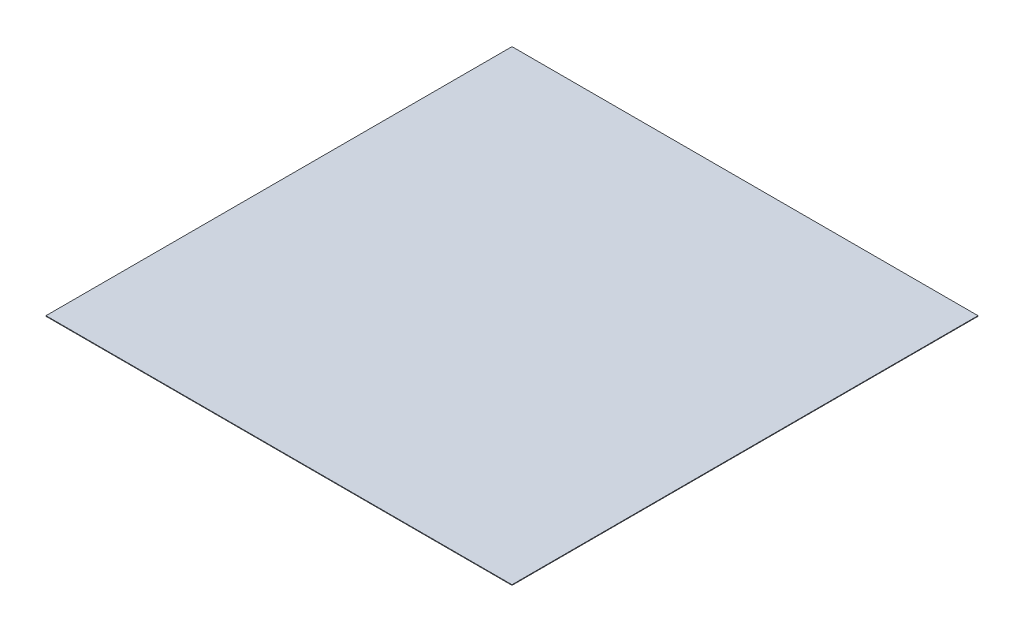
from build123d import *

# Parameters (mm, degrees)
SKETCH1_W           = 20320
SKETCH1_H           = 25.4
BOSS_EXTRUDE1_DEPTH = 10160


with BuildPart() as part:
    # Sketch1 → Boss-Extrude1 (new, symmetric)
    with BuildSketch(Plane(origin=(0, 0, 0), x_dir=(0, 0, -1), z_dir=(1, 0, 0))):
        Rectangle(SKETCH1_W, SKETCH1_H)
    extrude(amount=BOSS_EXTRUDE1_DEPTH, both=True)


solid = part.part
